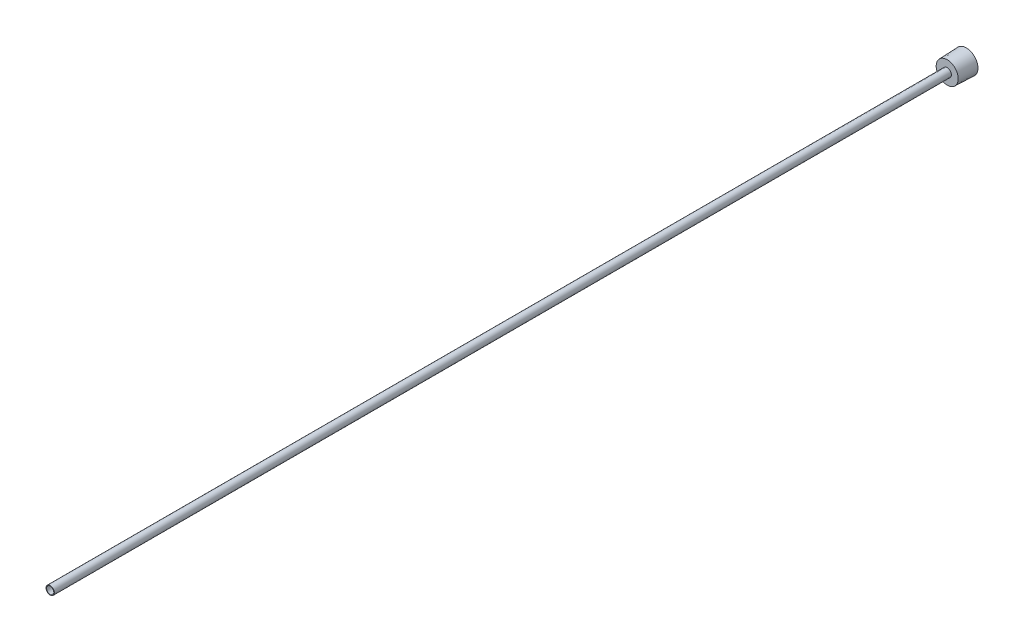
ISO-10303-21;
HEADER;
FILE_DESCRIPTION(('STEP AP214'),'2;1');
FILE_NAME('part.step','',(''),(''),'','','');
FILE_SCHEMA(('AUTOMOTIVE_DESIGN { 1 0 10303 214 1 1 1 1 }'));
ENDSEC;
DATA;
#1=APPLICATION_CONTEXT('core data for automotive mechanical design processes');
#2=APPLICATION_PROTOCOL_DEFINITION('international standard','automotive_design',2000,#1);
#3=PRODUCT_CONTEXT('',#1,'mechanical');
#4=PRODUCT('Part','Part','',(#3));
#5=PRODUCT_RELATED_PRODUCT_CATEGORY('part','',(#4));
#6=PRODUCT_DEFINITION_FORMATION('','',#4);
#7=PRODUCT_DEFINITION_CONTEXT('part definition',#1,'design');
#8=PRODUCT_DEFINITION('design','',#6,#7);
#9=PRODUCT_DEFINITION_SHAPE('','',#8);
#10=(LENGTH_UNIT() NAMED_UNIT(*) SI_UNIT(.MILLI.,.METRE.));
#11=(NAMED_UNIT(*) PLANE_ANGLE_UNIT() SI_UNIT($,.RADIAN.));
#12=(NAMED_UNIT(*) SI_UNIT($,.STERADIAN.) SOLID_ANGLE_UNIT());
#13=UNCERTAINTY_MEASURE_WITH_UNIT(LENGTH_MEASURE(1.E-05),#10,'distance_accuracy_value','');
#14=(GEOMETRIC_REPRESENTATION_CONTEXT(3) GLOBAL_UNCERTAINTY_ASSIGNED_CONTEXT((#13)) GLOBAL_UNIT_ASSIGNED_CONTEXT((#10,
#11,#12)) REPRESENTATION_CONTEXT('',''));
#15=CARTESIAN_POINT('',(0.,0.,0.));
#16=DIRECTION('',(0.,0.,1.));
#17=DIRECTION('',(1.,0.,0.));
#18=AXIS2_PLACEMENT_3D('',#15,#16,#17);
#19=CARTESIAN_POINT('',(0.,0.,0.));
#20=DIRECTION('',(0.,0.,1.));
#21=DIRECTION('',(1.,0.,0.));
#22=AXIS2_PLACEMENT_3D('',#19,#20,#21);
#23=CYLINDRICAL_SURFACE('',#22,1.2065);
#24=CARTESIAN_POINT('',(0.,0.,304.8));
#25=DIRECTION('',(0.,0.,1.));
#26=DIRECTION('',(1.,0.,0.));
#27=AXIS2_PLACEMENT_3D('',#24,#25,#26);
#28=CIRCLE('',#27,1.2065);
#29=CARTESIAN_POINT('',(1.2065,0.,304.8));
#30=VERTEX_POINT('',#29);
#31=EDGE_CURVE('E142',#30,#30,#28,.T.);
#32=CARTESIAN_POINT('',(0.,0.,3.96875));
#33=DIRECTION('',(0.,0.,-1.));
#34=DIRECTION('',(-1.,0.,0.));
#35=AXIS2_PLACEMENT_3D('',#32,#33,#34);
#36=CIRCLE('',#35,1.2065);
#37=CARTESIAN_POINT('',(1.2065,0.,3.96875));
#38=VERTEX_POINT('',#37);
#39=EDGE_CURVE('E37',#38,#38,#36,.F.);
#40=CARTESIAN_POINT('',(1.2065,0.,304.8));
#41=CARTESIAN_POINT('',(1.2065,0.,301.666341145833));
#42=CARTESIAN_POINT('',(1.2065,0.,298.532682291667));
#43=CARTESIAN_POINT('',(1.2065,0.,292.265364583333));
#44=CARTESIAN_POINT('',(1.2065,0.,289.131705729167));
#45=CARTESIAN_POINT('',(1.2065,0.,282.864388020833));
#46=CARTESIAN_POINT('',(1.2065,0.,279.730729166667));
#47=CARTESIAN_POINT('',(1.2065,0.,273.463411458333));
#48=CARTESIAN_POINT('',(1.2065,0.,270.329752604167));
#49=CARTESIAN_POINT('',(1.2065,0.,264.062434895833));
#50=CARTESIAN_POINT('',(1.2065,0.,260.928776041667));
#51=CARTESIAN_POINT('',(1.2065,0.,254.661458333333));
#52=CARTESIAN_POINT('',(1.2065,0.,251.527799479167));
#53=CARTESIAN_POINT('',(1.2065,0.,245.260481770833));
#54=CARTESIAN_POINT('',(1.2065,0.,242.126822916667));
#55=CARTESIAN_POINT('',(1.2065,0.,235.859505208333));
#56=CARTESIAN_POINT('',(1.2065,0.,232.725846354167));
#57=CARTESIAN_POINT('',(1.2065,0.,226.458528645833));
#58=CARTESIAN_POINT('',(1.2065,0.,223.324869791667));
#59=CARTESIAN_POINT('',(1.2065,0.,217.057552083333));
#60=CARTESIAN_POINT('',(1.2065,0.,213.923893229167));
#61=CARTESIAN_POINT('',(1.2065,0.,207.656575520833));
#62=CARTESIAN_POINT('',(1.2065,0.,204.522916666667));
#63=CARTESIAN_POINT('',(1.2065,0.,198.255598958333));
#64=CARTESIAN_POINT('',(1.2065,0.,195.121940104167));
#65=CARTESIAN_POINT('',(1.2065,0.,188.854622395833));
#66=CARTESIAN_POINT('',(1.2065,0.,185.720963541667));
#67=CARTESIAN_POINT('',(1.2065,0.,179.453645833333));
#68=CARTESIAN_POINT('',(1.2065,0.,176.319986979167));
#69=CARTESIAN_POINT('',(1.2065,0.,170.052669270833));
#70=CARTESIAN_POINT('',(1.2065,0.,166.919010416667));
#71=CARTESIAN_POINT('',(1.2065,0.,160.651692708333));
#72=CARTESIAN_POINT('',(1.2065,0.,157.518033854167));
#73=CARTESIAN_POINT('',(1.2065,0.,151.250716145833));
#74=CARTESIAN_POINT('',(1.2065,0.,148.117057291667));
#75=CARTESIAN_POINT('',(1.2065,0.,141.849739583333));
#76=CARTESIAN_POINT('',(1.2065,0.,138.716080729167));
#77=CARTESIAN_POINT('',(1.2065,0.,132.448763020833));
#78=CARTESIAN_POINT('',(1.2065,0.,129.315104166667));
#79=CARTESIAN_POINT('',(1.2065,0.,123.047786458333));
#80=CARTESIAN_POINT('',(1.2065,0.,119.914127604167));
#81=CARTESIAN_POINT('',(1.2065,0.,113.646809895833));
#82=CARTESIAN_POINT('',(1.2065,0.,110.513151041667));
#83=CARTESIAN_POINT('',(1.2065,0.,104.245833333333));
#84=CARTESIAN_POINT('',(1.2065,0.,101.112174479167));
#85=CARTESIAN_POINT('',(1.2065,0.,94.8448567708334));
#86=CARTESIAN_POINT('',(1.2065,0.,91.7111979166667));
#87=CARTESIAN_POINT('',(1.2065,0.,85.4438802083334));
#88=CARTESIAN_POINT('',(1.2065,0.,82.3102213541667));
#89=CARTESIAN_POINT('',(1.2065,0.,76.0429036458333));
#90=CARTESIAN_POINT('',(1.2065,0.,72.9092447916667));
#91=CARTESIAN_POINT('',(1.2065,0.,66.6419270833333));
#92=CARTESIAN_POINT('',(1.2065,0.,63.5082682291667));
#93=CARTESIAN_POINT('',(1.2065,0.,57.2409505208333));
#94=CARTESIAN_POINT('',(1.2065,0.,54.1072916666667));
#95=CARTESIAN_POINT('',(1.2065,0.,47.8399739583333));
#96=CARTESIAN_POINT('',(1.2065,0.,44.7063151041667));
#97=CARTESIAN_POINT('',(1.2065,0.,38.4389973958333));
#98=CARTESIAN_POINT('',(1.2065,0.,35.3053385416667));
#99=CARTESIAN_POINT('',(1.2065,0.,29.0380208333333));
#100=CARTESIAN_POINT('',(1.2065,0.,25.9043619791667));
#101=CARTESIAN_POINT('',(1.2065,0.,19.6370442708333));
#102=CARTESIAN_POINT('',(1.2065,0.,16.5033854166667));
#103=CARTESIAN_POINT('',(1.2065,0.,10.2360677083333));
#104=CARTESIAN_POINT('',(1.2065,0.,7.10240885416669));
#105=CARTESIAN_POINT('',(1.2065,0.,3.96875000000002));
#106=B_SPLINE_CURVE_WITH_KNOTS('',3,(#40,#41,#42,#43,#44,#45,#46,#47,#48,#49,#50,#51,#52,#53,
#54,#55,#56,#57,#58,#59,#60,#61,#62,#63,#64,#65,#66,#67,#68,#69,#70,#71,#72,#73,#74,#75,#76,#77,
#78,#79,#80,#81,#82,#83,#84,#85,#86,#87,#88,#89,#90,#91,#92,#93,#94,#95,#96,#97,#98,#99,#100,
#101,#102,#103,#104,#105),.UNSPECIFIED.,.F.,.F.,(4,2,2,2,2,2,2,2,2,2,2,2,2,2,2,2,2,2,2,2,2,2,2,
2,2,2,2,2,2,2,2,2,4),(0.,9.4009765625,18.801953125,28.2029296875,37.60390625,47.0048828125,
56.405859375,65.8068359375,75.2078125,84.6087890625,94.009765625,103.4107421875,112.81171875,
122.2126953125,131.613671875,141.0146484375,150.415625,159.8166015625,169.217578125,
178.6185546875,188.01953125,197.4205078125,206.821484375,216.2224609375,225.6234375,
235.0244140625,244.425390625,253.8263671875,263.22734375,272.6283203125,282.029296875,
291.4302734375,300.83125),.UNSPECIFIED.);
#107=EDGE_CURVE('BSEAM33',#30,#38,#106,.T.);
#108=ORIENTED_EDGE('',*,*,#31,.T.);
#109=ORIENTED_EDGE('',*,*,#39,.F.);
#110=ORIENTED_EDGE('',*,*,#107,.T.);
#111=ORIENTED_EDGE('',*,*,#107,.F.);
#112=EDGE_LOOP('',(#108,#110,#109,#111));
#113=FACE_BOUND('',#112,.T.);
#114=ADVANCED_FACE('F33',(#113),#23,.F.);
#115=CARTESIAN_POINT('',(0.,0.,0.));
#116=DIRECTION('',(0.,0.,1.));
#117=DIRECTION('',(1.,0.,0.));
#118=AXIS2_PLACEMENT_3D('',#115,#116,#117);
#119=PLANE('',#118);
#120=DIRECTION('',(-0.866025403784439,0.5,0.));
#121=VECTOR('',#120,1.);
#122=CARTESIAN_POINT('',(0.,-2.7569630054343,0.));
#123=LINE('',#122,#121);
#124=CARTESIAN_POINT('',(0.,-2.7569630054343,0.));
#125=VERTEX_POINT('',#124);
#126=CARTESIAN_POINT('',(-2.3876,-1.37848150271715,0.));
#127=VERTEX_POINT('',#126);
#128=EDGE_CURVE('E124',#125,#127,#123,.T.);
#129=ORIENTED_EDGE('',*,*,#128,.F.);
#130=DIRECTION('',(-0.866025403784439,-0.5,0.));
#131=VECTOR('',#130,1.);
#132=CARTESIAN_POINT('',(2.3876,-1.37848150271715,0.));
#133=LINE('',#132,#131);
#134=CARTESIAN_POINT('',(2.3876,-1.37848150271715,0.));
#135=VERTEX_POINT('',#134);
#136=EDGE_CURVE('E49',#135,#125,#133,.T.);
#137=ORIENTED_EDGE('',*,*,#136,.F.);
#138=DIRECTION('',(0.,-1.,0.));
#139=VECTOR('',#138,1.);
#140=CARTESIAN_POINT('',(2.3876,1.37848150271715,0.));
#141=LINE('',#140,#139);
#142=CARTESIAN_POINT('',(2.3876,1.37848150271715,0.));
#143=VERTEX_POINT('',#142);
#144=EDGE_CURVE('E133',#143,#135,#141,.T.);
#145=ORIENTED_EDGE('',*,*,#144,.F.);
#146=DIRECTION('',(0.866025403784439,-0.5,0.));
#147=VECTOR('',#146,1.);
#148=CARTESIAN_POINT('',(0.,2.7569630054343,0.));
#149=LINE('',#148,#147);
#150=CARTESIAN_POINT('',(0.,2.7569630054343,0.));
#151=VERTEX_POINT('',#150);
#152=EDGE_CURVE('E131',#151,#143,#149,.T.);
#153=ORIENTED_EDGE('',*,*,#152,.F.);
#154=DIRECTION('',(0.866025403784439,0.5,0.));
#155=VECTOR('',#154,1.);
#156=CARTESIAN_POINT('',(-2.3876,1.37848150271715,0.));
#157=LINE('',#156,#155);
#158=CARTESIAN_POINT('',(-2.3876,1.37848150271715,0.));
#159=VERTEX_POINT('',#158);
#160=EDGE_CURVE('E97',#159,#151,#157,.T.);
#161=ORIENTED_EDGE('',*,*,#160,.F.);
#162=DIRECTION('',(0.,1.,0.));
#163=VECTOR('',#162,1.);
#164=CARTESIAN_POINT('',(-2.3876,-1.37848150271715,0.));
#165=LINE('',#164,#163);
#166=EDGE_CURVE('E127',#127,#159,#165,.T.);
#167=ORIENTED_EDGE('',*,*,#166,.F.);
#168=EDGE_LOOP('',(#129,#137,#145,#153,#161,#167));
#169=FACE_BOUND('',#168,.T.);
#170=CARTESIAN_POINT('',(0.,0.,0.));
#171=DIRECTION('',(0.,0.,1.));
#172=DIRECTION('',(1.,0.,0.));
#173=AXIS2_PLACEMENT_3D('',#170,#171,#172);
#174=CIRCLE('',#173,3.8989);
#175=CARTESIAN_POINT('',(3.8989,0.,0.));
#176=VERTEX_POINT('',#175);
#177=EDGE_CURVE('E11',#176,#176,#174,.T.);
#178=ORIENTED_EDGE('',*,*,#177,.F.);
#179=EDGE_LOOP('',(#178));
#180=FACE_BOUND('',#179,.T.);
#181=ADVANCED_FACE('F35',(#169,#180),#119,.F.);
#182=CARTESIAN_POINT('',(0.,0.,0.));
#183=DIRECTION('',(0.,0.,-1.));
#184=DIRECTION('',(-1.,0.,0.));
#185=AXIS2_PLACEMENT_3D('',#182,#183,#184);
#186=CONICAL_SURFACE('',#185,3.8989,0.0364424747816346);
#187=CARTESIAN_POINT('',(0.,0.,6.35));
#188=DIRECTION('',(0.,0.,1.));
#189=DIRECTION('',(1.,0.,0.));
#190=AXIS2_PLACEMENT_3D('',#187,#188,#189);
#191=CIRCLE('',#190,3.66738778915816);
#192=CARTESIAN_POINT('',(3.66738778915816,0.,6.35));
#193=VERTEX_POINT('',#192);
#194=EDGE_CURVE('E42',#193,#193,#191,.T.);
#195=ORIENTED_EDGE('',*,*,#194,.F.);
#196=EDGE_LOOP('',(#195));
#197=FACE_BOUND('',#196,.T.);
#198=ORIENTED_EDGE('',*,*,#177,.T.);
#199=EDGE_LOOP('',(#198));
#200=FACE_BOUND('',#199,.T.);
#201=ADVANCED_FACE('F156',(#197,#200),#186,.T.);
#202=CARTESIAN_POINT('',(0.,3.66738778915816,6.35));
#203=DIRECTION('',(0.,0.,-1.));
#204=DIRECTION('',(-1.,0.,0.));
#205=AXIS2_PLACEMENT_3D('',#202,#203,#204);
#206=PLANE('',#205);
#207=CARTESIAN_POINT('',(0.,0.,6.35));
#208=DIRECTION('',(0.,0.,1.));
#209=DIRECTION('',(1.,0.,0.));
#210=AXIS2_PLACEMENT_3D('',#207,#208,#209);
#211=CIRCLE('',#210,1.3890625);
#212=CARTESIAN_POINT('',(1.3890625,0.,6.35));
#213=VERTEX_POINT('',#212);
#214=EDGE_CURVE('E148',#213,#213,#211,.T.);
#215=ORIENTED_EDGE('',*,*,#214,.F.);
#216=EDGE_LOOP('',(#215));
#217=FACE_BOUND('',#216,.T.);
#218=ORIENTED_EDGE('',*,*,#194,.T.);
#219=EDGE_LOOP('',(#218));
#220=FACE_BOUND('',#219,.T.);
#221=ADVANCED_FACE('F154',(#217,#220),#206,.F.);
#222=CARTESIAN_POINT('',(0.,0.,0.));
#223=DIRECTION('',(0.,0.,1.));
#224=DIRECTION('',(1.,0.,0.));
#225=AXIS2_PLACEMENT_3D('',#222,#223,#224);
#226=CYLINDRICAL_SURFACE('',#225,1.38906249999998);
#227=CARTESIAN_POINT('',(0.,0.,304.8));
#228=DIRECTION('',(0.,0.,1.));
#229=DIRECTION('',(1.,0.,0.));
#230=AXIS2_PLACEMENT_3D('',#227,#228,#229);
#231=CIRCLE('',#230,1.38906249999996);
#232=CARTESIAN_POINT('',(1.38906249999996,0.,304.8));
#233=VERTEX_POINT('',#232);
#234=EDGE_CURVE('E145',#233,#233,#231,.T.);
#235=ORIENTED_EDGE('',*,*,#234,.F.);
#236=EDGE_LOOP('',(#235));
#237=FACE_BOUND('',#236,.T.);
#238=ORIENTED_EDGE('',*,*,#214,.T.);
#239=EDGE_LOOP('',(#238));
#240=FACE_BOUND('',#239,.T.);
#241=ADVANCED_FACE('F190',(#237,#240),#226,.T.);
#242=CARTESIAN_POINT('',(0.,1.38906249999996,304.8));
#243=DIRECTION('',(0.,0.,-1.));
#244=DIRECTION('',(-1.,0.,0.));
#245=AXIS2_PLACEMENT_3D('',#242,#243,#244);
#246=PLANE('',#245);
#247=ORIENTED_EDGE('',*,*,#31,.F.);
#248=EDGE_LOOP('',(#247));
#249=FACE_BOUND('',#248,.T.);
#250=ORIENTED_EDGE('',*,*,#234,.T.);
#251=EDGE_LOOP('',(#250));
#252=FACE_BOUND('',#251,.T.);
#253=ADVANCED_FACE('F183',(#249,#252),#246,.F.);
#254=CARTESIAN_POINT('',(0.,-2.7569630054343,3.96875));
#255=DIRECTION('',(0.,0.,-1.));
#256=DIRECTION('',(-1.,0.,0.));
#257=AXIS2_PLACEMENT_3D('',#254,#255,#256);
#258=PLANE('',#257);
#259=DIRECTION('',(-0.866025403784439,-0.5,0.));
#260=VECTOR('',#259,1.);
#261=CARTESIAN_POINT('',(2.3876,-1.37848150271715,3.96875));
#262=LINE('',#261,#260);
#263=CARTESIAN_POINT('',(2.3876,-1.37848150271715,3.96875));
#264=VERTEX_POINT('',#263);
#265=CARTESIAN_POINT('',(0.,-2.7569630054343,3.96875));
#266=VERTEX_POINT('',#265);
#267=EDGE_CURVE('E135',#264,#266,#262,.T.);
#268=ORIENTED_EDGE('',*,*,#267,.T.);
#269=DIRECTION('',(-0.866025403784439,0.5,0.));
#270=VECTOR('',#269,1.);
#271=CARTESIAN_POINT('',(0.,-2.7569630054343,3.96875));
#272=LINE('',#271,#270);
#273=CARTESIAN_POINT('',(-2.3876,-1.37848150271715,3.96875));
#274=VERTEX_POINT('',#273);
#275=EDGE_CURVE('E118',#266,#274,#272,.T.);
#276=ORIENTED_EDGE('',*,*,#275,.T.);
#277=DIRECTION('',(0.,1.,0.));
#278=VECTOR('',#277,1.);
#279=CARTESIAN_POINT('',(-2.3876,-1.37848150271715,3.96875));
#280=LINE('',#279,#278);
#281=CARTESIAN_POINT('',(-2.3876,1.37848150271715,3.96875));
#282=VERTEX_POINT('',#281);
#283=EDGE_CURVE('E116',#274,#282,#280,.T.);
#284=ORIENTED_EDGE('',*,*,#283,.T.);
#285=DIRECTION('',(0.866025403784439,0.5,0.));
#286=VECTOR('',#285,1.);
#287=CARTESIAN_POINT('',(-2.3876,1.37848150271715,3.96875));
#288=LINE('',#287,#286);
#289=CARTESIAN_POINT('',(0.,2.7569630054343,3.96875));
#290=VERTEX_POINT('',#289);
#291=EDGE_CURVE('E94',#282,#290,#288,.T.);
#292=ORIENTED_EDGE('',*,*,#291,.T.);
#293=DIRECTION('',(0.866025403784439,-0.5,0.));
#294=VECTOR('',#293,1.);
#295=CARTESIAN_POINT('',(0.,2.7569630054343,3.96875));
#296=LINE('',#295,#294);
#297=CARTESIAN_POINT('',(2.3876,1.37848150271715,3.96875));
#298=VERTEX_POINT('',#297);
#299=EDGE_CURVE('E105',#290,#298,#296,.T.);
#300=ORIENTED_EDGE('',*,*,#299,.T.);
#301=DIRECTION('',(0.,-1.,0.));
#302=VECTOR('',#301,1.);
#303=CARTESIAN_POINT('',(2.3876,1.37848150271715,3.96875));
#304=LINE('',#303,#302);
#305=EDGE_CURVE('E109',#298,#264,#304,.T.);
#306=ORIENTED_EDGE('',*,*,#305,.T.);
#307=EDGE_LOOP('',(#268,#276,#284,#292,#300,#306));
#308=FACE_BOUND('',#307,.T.);
#309=ORIENTED_EDGE('',*,*,#39,.T.);
#310=EDGE_LOOP('',(#309));
#311=FACE_BOUND('',#310,.T.);
#312=ADVANCED_FACE('F112',(#308,#311),#258,.T.);
#313=CARTESIAN_POINT('',(2.3876,-1.37848150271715,3.96875));
#314=DIRECTION('',(0.5,-0.866025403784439,0.));
#315=DIRECTION('',(0.866025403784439,0.5,0.));
#316=AXIS2_PLACEMENT_3D('',#313,#314,#315);
#317=PLANE('',#316);
#318=ORIENTED_EDGE('',*,*,#136,.T.);
#319=DIRECTION('',(0.,0.,-1.));
#320=VECTOR('',#319,1.);
#321=CARTESIAN_POINT('',(0.,-2.7569630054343,3.96875));
#322=LINE('',#321,#320);
#323=EDGE_CURVE('E79',#266,#125,#322,.T.);
#324=ORIENTED_EDGE('',*,*,#323,.F.);
#325=ORIENTED_EDGE('',*,*,#267,.F.);
#326=DIRECTION('',(0.,0.,-1.));
#327=VECTOR('',#326,1.);
#328=CARTESIAN_POINT('',(2.3876,-1.37848150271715,3.96875));
#329=LINE('',#328,#327);
#330=EDGE_CURVE('E57',#264,#135,#329,.T.);
#331=ORIENTED_EDGE('',*,*,#330,.T.);
#332=EDGE_LOOP('',(#318,#324,#325,#331));
#333=FACE_BOUND('',#332,.T.);
#334=ADVANCED_FACE('F174',(#333),#317,.F.);
#335=CARTESIAN_POINT('',(2.3876,1.37848150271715,3.96875));
#336=DIRECTION('',(1.,0.,0.));
#337=DIRECTION('',(0.,0.,-1.));
#338=AXIS2_PLACEMENT_3D('',#335,#336,#337);
#339=PLANE('',#338);
#340=ORIENTED_EDGE('',*,*,#144,.T.);
#341=ORIENTED_EDGE('',*,*,#330,.F.);
#342=ORIENTED_EDGE('',*,*,#305,.F.);
#343=DIRECTION('',(0.,0.,-1.));
#344=VECTOR('',#343,1.);
#345=CARTESIAN_POINT('',(2.3876,1.37848150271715,3.96875));
#346=LINE('',#345,#344);
#347=EDGE_CURVE('E101',#298,#143,#346,.T.);
#348=ORIENTED_EDGE('',*,*,#347,.T.);
#349=EDGE_LOOP('',(#340,#341,#342,#348));
#350=FACE_BOUND('',#349,.T.);
#351=ADVANCED_FACE('F176',(#350),#339,.F.);
#352=CARTESIAN_POINT('',(0.,2.7569630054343,3.96875));
#353=DIRECTION('',(0.5,0.866025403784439,0.));
#354=DIRECTION('',(-0.866025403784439,0.5,0.));
#355=AXIS2_PLACEMENT_3D('',#352,#353,#354);
#356=PLANE('',#355);
#357=ORIENTED_EDGE('',*,*,#152,.T.);
#358=ORIENTED_EDGE('',*,*,#347,.F.);
#359=ORIENTED_EDGE('',*,*,#299,.F.);
#360=DIRECTION('',(0.,0.,-1.));
#361=VECTOR('',#360,1.);
#362=CARTESIAN_POINT('',(0.,2.7569630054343,3.96875));
#363=LINE('',#362,#361);
#364=EDGE_CURVE('E90',#290,#151,#363,.T.);
#365=ORIENTED_EDGE('',*,*,#364,.T.);
#366=EDGE_LOOP('',(#357,#358,#359,#365));
#367=FACE_BOUND('',#366,.T.);
#368=ADVANCED_FACE('F106',(#367),#356,.F.);
#369=CARTESIAN_POINT('',(-2.3876,1.37848150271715,3.96875));
#370=DIRECTION('',(-0.5,0.866025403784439,0.));
#371=DIRECTION('',(-0.866025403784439,-0.5,0.));
#372=AXIS2_PLACEMENT_3D('',#369,#370,#371);
#373=PLANE('',#372);
#374=ORIENTED_EDGE('',*,*,#160,.T.);
#375=ORIENTED_EDGE('',*,*,#364,.F.);
#376=ORIENTED_EDGE('',*,*,#291,.F.);
#377=DIRECTION('',(0.,0.,-1.));
#378=VECTOR('',#377,1.);
#379=CARTESIAN_POINT('',(-2.3876,1.37848150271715,3.96875));
#380=LINE('',#379,#378);
#381=EDGE_CURVE('E102',#282,#159,#380,.T.);
#382=ORIENTED_EDGE('',*,*,#381,.T.);
#383=EDGE_LOOP('',(#374,#375,#376,#382));
#384=FACE_BOUND('',#383,.T.);
#385=ADVANCED_FACE('F92',(#384),#373,.F.);
#386=CARTESIAN_POINT('',(-2.3876,-1.37848150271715,3.96875));
#387=DIRECTION('',(-1.,0.,0.));
#388=DIRECTION('',(0.,-1.,0.));
#389=AXIS2_PLACEMENT_3D('',#386,#387,#388);
#390=PLANE('',#389);
#391=ORIENTED_EDGE('',*,*,#166,.T.);
#392=ORIENTED_EDGE('',*,*,#381,.F.);
#393=ORIENTED_EDGE('',*,*,#283,.F.);
#394=DIRECTION('',(0.,0.,-1.));
#395=VECTOR('',#394,1.);
#396=CARTESIAN_POINT('',(-2.3876,-1.37848150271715,3.96875));
#397=LINE('',#396,#395);
#398=EDGE_CURVE('E139',#274,#127,#397,.T.);
#399=ORIENTED_EDGE('',*,*,#398,.T.);
#400=EDGE_LOOP('',(#391,#392,#393,#399));
#401=FACE_BOUND('',#400,.T.);
#402=ADVANCED_FACE('F246',(#401),#390,.F.);
#403=CARTESIAN_POINT('',(0.,-2.7569630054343,3.96875));
#404=DIRECTION('',(-0.5,-0.866025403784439,0.));
#405=DIRECTION('',(0.866025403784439,-0.5,0.));
#406=AXIS2_PLACEMENT_3D('',#403,#404,#405);
#407=PLANE('',#406);
#408=ORIENTED_EDGE('',*,*,#128,.T.);
#409=ORIENTED_EDGE('',*,*,#398,.F.);
#410=ORIENTED_EDGE('',*,*,#275,.F.);
#411=ORIENTED_EDGE('',*,*,#323,.T.);
#412=EDGE_LOOP('',(#408,#409,#410,#411));
#413=FACE_BOUND('',#412,.T.);
#414=ADVANCED_FACE('F172',(#413),#407,.F.);
#415=CLOSED_SHELL('',(#114,#181,#201,#221,#241,#253,#312,#334,#351,#368,#385,#402,#414));
#416=MANIFOLD_SOLID_BREP('B2',#415);
#417=ADVANCED_BREP_SHAPE_REPRESENTATION('',(#18,#416),#14);
#418=SHAPE_DEFINITION_REPRESENTATION(#9,#417);
ENDSEC;
END-ISO-10303-21;
